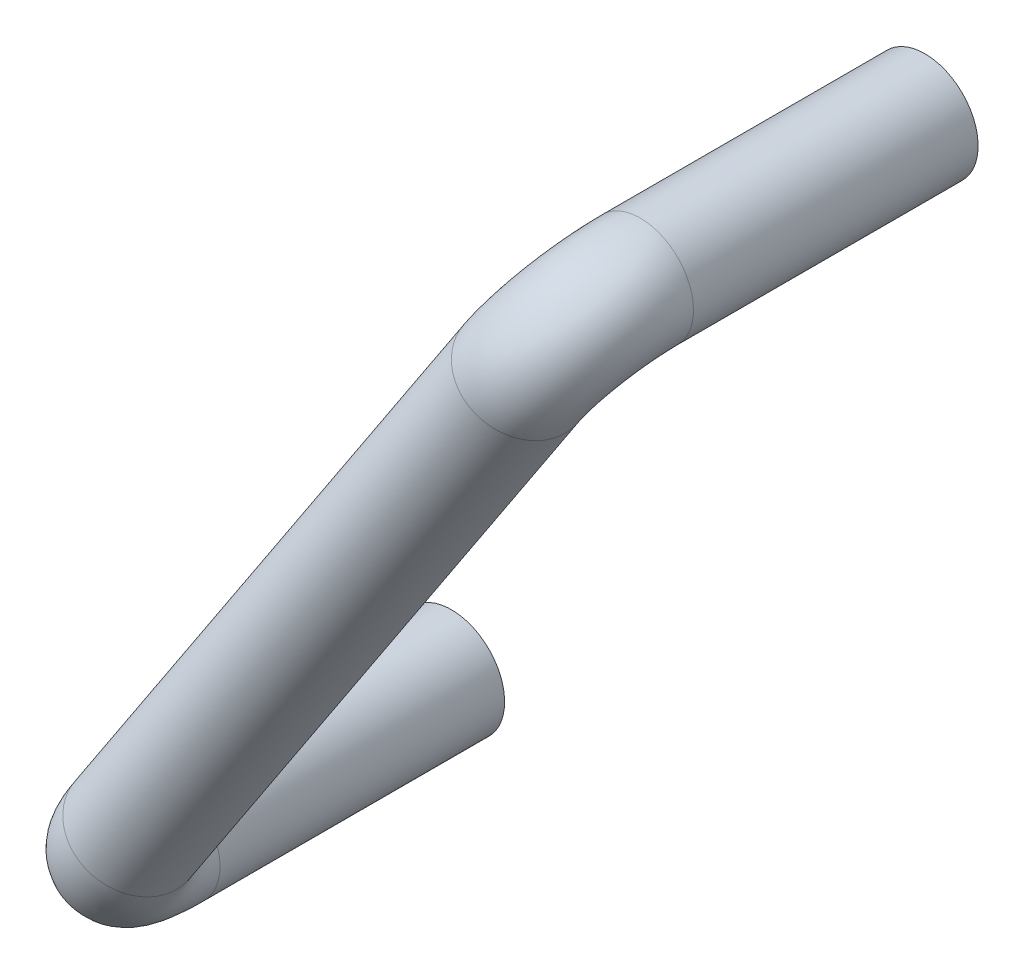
ISO-10303-21;
HEADER;
FILE_DESCRIPTION(('STEP AP214'),'2;1');
FILE_NAME('part.step','',(''),(''),'','','');
FILE_SCHEMA(('AUTOMOTIVE_DESIGN { 1 0 10303 214 1 1 1 1 }'));
ENDSEC;
DATA;
#1=APPLICATION_CONTEXT('core data for automotive mechanical design processes');
#2=APPLICATION_PROTOCOL_DEFINITION('international standard','automotive_design',2000,#1);
#3=PRODUCT_CONTEXT('',#1,'mechanical');
#4=PRODUCT('Part','Part','',(#3));
#5=PRODUCT_RELATED_PRODUCT_CATEGORY('part','',(#4));
#6=PRODUCT_DEFINITION_FORMATION('','',#4);
#7=PRODUCT_DEFINITION_CONTEXT('part definition',#1,'design');
#8=PRODUCT_DEFINITION('design','',#6,#7);
#9=PRODUCT_DEFINITION_SHAPE('','',#8);
#10=(LENGTH_UNIT() NAMED_UNIT(*) SI_UNIT(.MILLI.,.METRE.));
#11=(NAMED_UNIT(*) PLANE_ANGLE_UNIT() SI_UNIT($,.RADIAN.));
#12=(NAMED_UNIT(*) SI_UNIT($,.STERADIAN.) SOLID_ANGLE_UNIT());
#13=UNCERTAINTY_MEASURE_WITH_UNIT(LENGTH_MEASURE(1.E-05),#10,'distance_accuracy_value','');
#14=(GEOMETRIC_REPRESENTATION_CONTEXT(3) GLOBAL_UNCERTAINTY_ASSIGNED_CONTEXT((#13)) GLOBAL_UNIT_ASSIGNED_CONTEXT((#10,
#11,#12)) REPRESENTATION_CONTEXT('',''));
#15=CARTESIAN_POINT('',(0.,0.,0.));
#16=DIRECTION('',(0.,0.,1.));
#17=DIRECTION('',(1.,0.,0.));
#18=AXIS2_PLACEMENT_3D('',#15,#16,#17);
#19=CARTESIAN_POINT('',(0.,-13.5,-4.3));
#20=DIRECTION('',(0.,0.,1.));
#21=DIRECTION('',(1.,0.,0.));
#22=AXIS2_PLACEMENT_3D('',#19,#20,#21);
#23=PLANE('',#22);
#24=CARTESIAN_POINT('',(0.,-13.5,-4.3));
#25=DIRECTION('',(0.,0.,1.));
#26=DIRECTION('',(0.,-1.,0.));
#27=AXIS2_PLACEMENT_3D('',#24,#25,#26);
#28=CIRCLE('',#27,1.);
#29=CARTESIAN_POINT('',(0.,-14.5,-4.3));
#30=VERTEX_POINT('',#29);
#31=EDGE_CURVE('E18',#30,#30,#28,.T.);
#32=ORIENTED_EDGE('',*,*,#31,.F.);
#33=EDGE_LOOP('',(#32));
#34=FACE_BOUND('',#33,.T.);
#35=ADVANCED_FACE('F15',(#34),#23,.F.);
#36=CARTESIAN_POINT('',(8.9,0.,-4.3));
#37=DIRECTION('',(0.,0.,-1.));
#38=DIRECTION('',(0.,1.,0.));
#39=AXIS2_PLACEMENT_3D('',#36,#37,#38);
#40=PLANE('',#39);
#41=CARTESIAN_POINT('',(8.9,0.,-4.3));
#42=DIRECTION('',(0.,0.,-1.));
#43=DIRECTION('',(-1.,0.,0.));
#44=AXIS2_PLACEMENT_3D('',#41,#42,#43);
#45=CIRCLE('',#44,1.);
#46=CARTESIAN_POINT('',(7.9,0.,-4.3));
#47=VERTEX_POINT('',#46);
#48=EDGE_CURVE('E50',#47,#47,#45,.F.);
#49=ORIENTED_EDGE('',*,*,#48,.F.);
#50=EDGE_LOOP('',(#49));
#51=FACE_BOUND('',#50,.T.);
#52=ADVANCED_FACE('F60',(#51),#40,.T.);
#53=CARTESIAN_POINT('',(0.,-13.5,-4.3));
#54=DIRECTION('',(0.,0.,1.));
#55=DIRECTION('',(0.,-1.,0.));
#56=AXIS2_PLACEMENT_3D('',#53,#54,#55);
#57=CYLINDRICAL_SURFACE('',#56,1.);
#58=CARTESIAN_POINT('',(-6.11490025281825E-13,-13.499999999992,1.05));
#59=DIRECTION('',(0.,0.,1.));
#60=DIRECTION('',(-0.550411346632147,-0.834893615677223,0.));
#61=AXIS2_PLACEMENT_3D('',#58,#59,#60);
#62=CIRCLE('',#61,1.);
#63=CARTESIAN_POINT('',(-0.550411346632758,-14.3348936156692,1.05));
#64=VERTEX_POINT('',#63);
#65=EDGE_CURVE('E48',#64,#64,#62,.T.);
#66=ORIENTED_EDGE('',*,*,#65,.F.);
#67=EDGE_LOOP('',(#66));
#68=FACE_BOUND('',#67,.T.);
#69=ORIENTED_EDGE('',*,*,#31,.T.);
#70=EDGE_LOOP('',(#69));
#71=FACE_BOUND('',#70,.T.);
#72=ADVANCED_FACE('F57',(#68,#71),#57,.T.);
#73=CARTESIAN_POINT('',(8.9,0.,1.05));
#74=DIRECTION('',(0.,0.,-1.));
#75=DIRECTION('',(-1.,0.,0.));
#76=AXIS2_PLACEMENT_3D('',#73,#74,#75);
#77=CYLINDRICAL_SURFACE('',#76,1.);
#78=ORIENTED_EDGE('',*,*,#48,.T.);
#79=EDGE_LOOP('',(#78));
#80=FACE_BOUND('',#79,.T.);
#81=CARTESIAN_POINT('',(8.90000000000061,0.,1.05));
#82=DIRECTION('',(0.,0.,-1.));
#83=DIRECTION('',(0.550411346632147,0.834893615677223,0.));
#84=AXIS2_PLACEMENT_3D('',#81,#82,#83);
#85=CIRCLE('',#84,1.);
#86=CARTESIAN_POINT('',(9.45041134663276,0.834893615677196,1.05));
#87=VERTEX_POINT('',#86);
#88=EDGE_CURVE('E27',#87,#87,#85,.F.);
#89=ORIENTED_EDGE('',*,*,#88,.F.);
#90=EDGE_LOOP('',(#89));
#91=FACE_BOUND('',#90,.T.);
#92=ADVANCED_FACE('F43',(#80,#91),#77,.T.);
#93=CARTESIAN_POINT('',(0.798096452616,-12.28940425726,1.05));
#94=DIRECTION('',(-0.834893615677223,0.550411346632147,0.));
#95=DIRECTION('',(0.,0.,-1.));
#96=AXIS2_PLACEMENT_3D('',#93,#94,#95);
#97=TOROIDAL_SURFACE('',#96,1.45,1.);
#98=CARTESIAN_POINT('',(0.798096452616,-12.28940425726,2.5));
#99=DIRECTION('',(0.550411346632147,0.834893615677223,0.));
#100=DIRECTION('',(-0.834893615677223,0.550411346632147,0.));
#101=AXIS2_PLACEMENT_3D('',#98,#99,#100);
#102=CIRCLE('',#101,1.);
#103=CARTESIAN_POINT('',(-0.0367971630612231,-11.7389929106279,2.5));
#104=VERTEX_POINT('',#103);
#105=EDGE_CURVE('E22',#104,#104,#102,.T.);
#106=ORIENTED_EDGE('',*,*,#105,.F.);
#107=EDGE_LOOP('',(#106));
#108=FACE_BOUND('',#107,.T.);
#109=ORIENTED_EDGE('',*,*,#65,.T.);
#110=EDGE_LOOP('',(#109));
#111=FACE_BOUND('',#110,.T.);
#112=ADVANCED_FACE('F39',(#108,#111),#97,.T.);
#113=CARTESIAN_POINT('',(8.101903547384,-1.210595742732,1.05));
#114=DIRECTION('',(-0.834893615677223,0.550411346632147,0.));
#115=DIRECTION('',(0.,0.,-1.));
#116=AXIS2_PLACEMENT_3D('',#113,#114,#115);
#117=TOROIDAL_SURFACE('',#116,1.45,1.);
#118=ORIENTED_EDGE('',*,*,#88,.T.);
#119=EDGE_LOOP('',(#118));
#120=FACE_BOUND('',#119,.T.);
#121=CARTESIAN_POINT('',(8.10190354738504,-1.21059574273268,2.5));
#122=DIRECTION('',(0.550411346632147,0.834893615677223,0.));
#123=DIRECTION('',(-0.834893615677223,0.550411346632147,0.));
#124=AXIS2_PLACEMENT_3D('',#121,#122,#123);
#125=CIRCLE('',#124,1.);
#126=CARTESIAN_POINT('',(7.26700993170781,-0.660184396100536,2.5));
#127=VERTEX_POINT('',#126);
#128=EDGE_CURVE('E10',#127,#127,#125,.F.);
#129=ORIENTED_EDGE('',*,*,#128,.F.);
#130=EDGE_LOOP('',(#129));
#131=FACE_BOUND('',#130,.T.);
#132=ADVANCED_FACE('F34',(#120,#131),#117,.T.);
#133=CARTESIAN_POINT('',(0.798096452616,-12.28940425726,2.5));
#134=DIRECTION('',(0.550411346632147,0.834893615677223,0.));
#135=DIRECTION('',(-0.834893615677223,0.550411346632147,0.));
#136=AXIS2_PLACEMENT_3D('',#133,#134,#135);
#137=CYLINDRICAL_SURFACE('',#136,1.);
#138=ORIENTED_EDGE('',*,*,#128,.T.);
#139=EDGE_LOOP('',(#138));
#140=FACE_BOUND('',#139,.T.);
#141=ORIENTED_EDGE('',*,*,#105,.T.);
#142=EDGE_LOOP('',(#141));
#143=FACE_BOUND('',#142,.T.);
#144=ADVANCED_FACE('F38',(#140,#143),#137,.T.);
#145=CLOSED_SHELL('',(#35,#52,#72,#92,#112,#132,#144));
#146=MANIFOLD_SOLID_BREP('B1',#145);
#147=ADVANCED_BREP_SHAPE_REPRESENTATION('',(#18,#146),#14);
#148=SHAPE_DEFINITION_REPRESENTATION(#9,#147);
ENDSEC;
END-ISO-10303-21;
